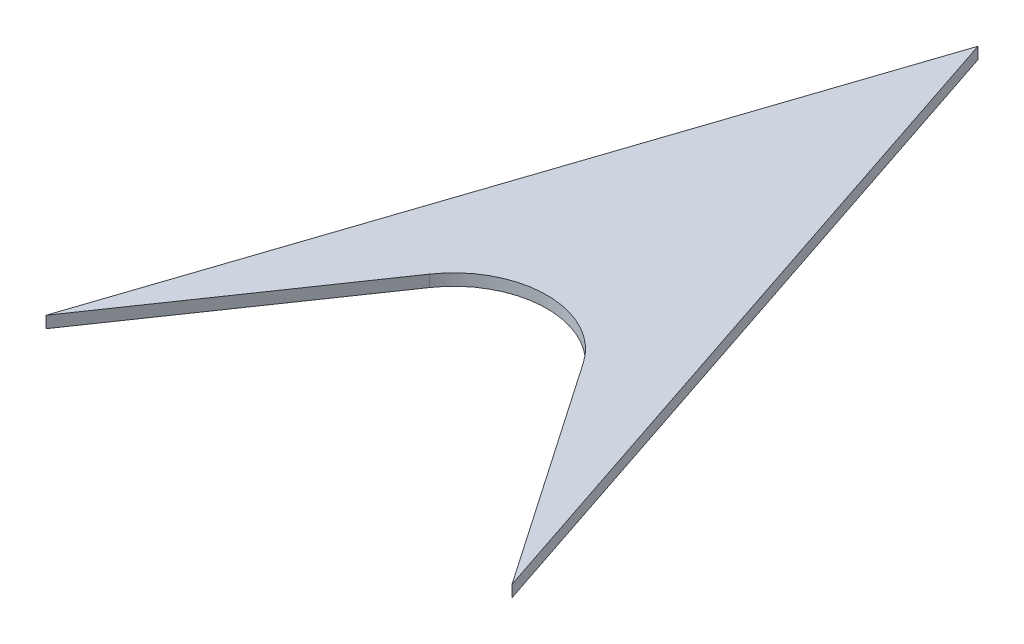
from build123d import *

# Parameters (mm, degrees)
EXTRUDE1_DEPTH = 1


with BuildPart() as part:
    # Sketch1 → Extrude1 (new body)
    with BuildSketch(Plane(origin=(0, 0, 0), x_dir=(1, 0, 0), z_dir=(0, 1, 0))):
        with BuildLine():
            Line((20.000005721, -15.000003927), (0, 45))
            Line((0, 45), (-19.999994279, -15.000003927))
            Line((-19.999994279, -15.000003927), (-6.59539112, 4.527409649))
            ThreePointArc((-6.59539112, 4.527409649), (-1.593e-06, 7.999788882), (6.595389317, 4.527412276))
            Line((6.595389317, 4.527412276), (20.000005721, -15.000003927))
        make_face()
    extrude(amount=EXTRUDE1_DEPTH)


solid = part.part
